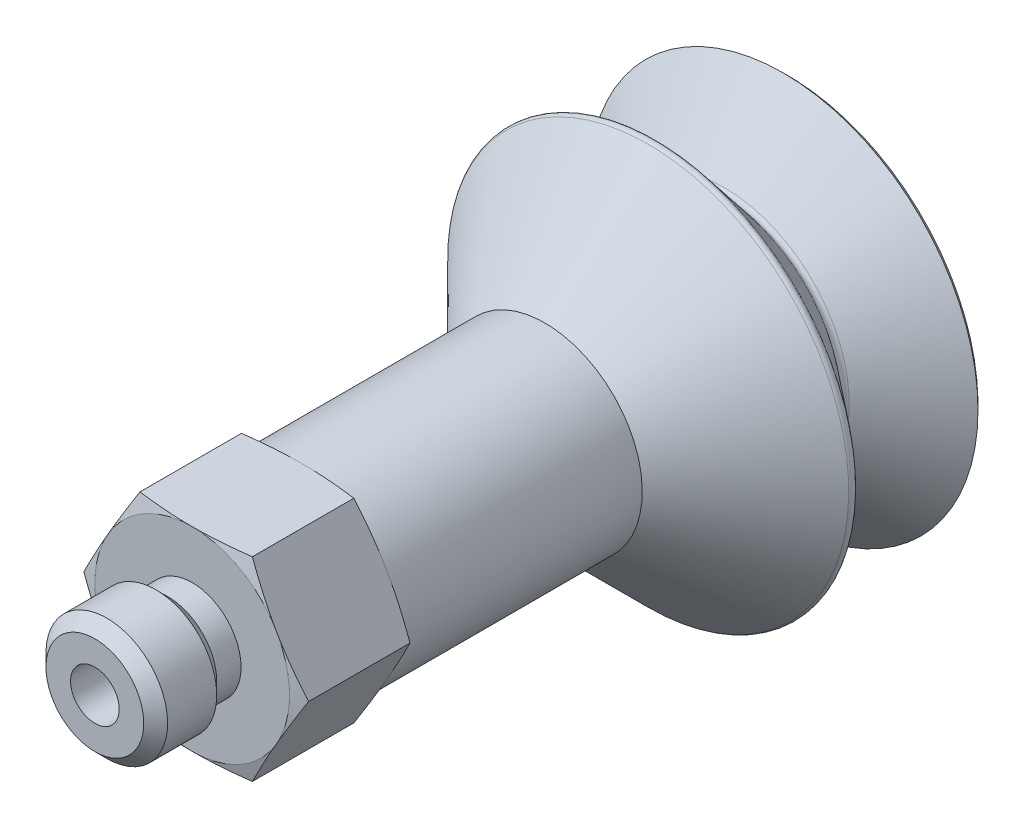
ISO-10303-21;
HEADER;
FILE_DESCRIPTION(('STEP AP214'),'2;1');
FILE_NAME('part.step','',(''),(''),'','','');
FILE_SCHEMA(('AUTOMOTIVE_DESIGN { 1 0 10303 214 1 1 1 1 }'));
ENDSEC;
DATA;
#1=APPLICATION_CONTEXT('core data for automotive mechanical design processes');
#2=APPLICATION_PROTOCOL_DEFINITION('international standard','automotive_design',2000,#1);
#3=PRODUCT_CONTEXT('',#1,'mechanical');
#4=PRODUCT('Part','Part','',(#3));
#5=PRODUCT_RELATED_PRODUCT_CATEGORY('part','',(#4));
#6=PRODUCT_DEFINITION_FORMATION('','',#4);
#7=PRODUCT_DEFINITION_CONTEXT('part definition',#1,'design');
#8=PRODUCT_DEFINITION('design','',#6,#7);
#9=PRODUCT_DEFINITION_SHAPE('','',#8);
#10=(LENGTH_UNIT() NAMED_UNIT(*) SI_UNIT(.MILLI.,.METRE.));
#11=(NAMED_UNIT(*) PLANE_ANGLE_UNIT() SI_UNIT($,.RADIAN.));
#12=(NAMED_UNIT(*) SI_UNIT($,.STERADIAN.) SOLID_ANGLE_UNIT());
#13=UNCERTAINTY_MEASURE_WITH_UNIT(LENGTH_MEASURE(1.E-05),#10,'distance_accuracy_value','');
#14=(GEOMETRIC_REPRESENTATION_CONTEXT(3) GLOBAL_UNCERTAINTY_ASSIGNED_CONTEXT((#13)) GLOBAL_UNIT_ASSIGNED_CONTEXT((#10,
#11,#12)) REPRESENTATION_CONTEXT('',''));
#15=CARTESIAN_POINT('',(0.,0.,0.));
#16=DIRECTION('',(0.,0.,1.));
#17=DIRECTION('',(1.,0.,0.));
#18=AXIS2_PLACEMENT_3D('',#15,#16,#17);
#19=CARTESIAN_POINT('',(4.61880215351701,0.,24.5));
#20=DIRECTION('',(-0.866025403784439,-0.5,0.));
#21=DIRECTION('',(0.,0.,-1.));
#22=AXIS2_PLACEMENT_3D('',#19,#20,#21);
#23=PLANE('',#22);
#24=CARTESIAN_POINT('',(4.61880215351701,0.,20.1658075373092));
#25=CARTESIAN_POINT('',(4.0000000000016,1.07179676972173,20.));
#26=CARTESIAN_POINT('',(3.46410161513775,2.00000000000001,20.));
#27=B_SPLINE_CURVE_WITH_KNOTS('',2,(#24,#25,#26),.UNSPECIFIED.,.F.,.F.,(3,3),(0.,1.),.UNSPECIFIED.);
#28=CARTESIAN_POINT('',(4.61880215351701,0.,20.1658075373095));
#29=VERTEX_POINT('',#28);
#30=CARTESIAN_POINT('',(3.46410161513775,2.,20.));
#31=VERTEX_POINT('',#30);
#32=EDGE_CURVE('E597',#29,#31,#27,.T.);
#33=ORIENTED_EDGE('',*,*,#32,.T.);
#34=CARTESIAN_POINT('',(3.46410161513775,2.00000000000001,20.));
#35=CARTESIAN_POINT('',(2.92820323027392,2.92820323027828,20.));
#36=CARTESIAN_POINT('',(2.30940107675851,4.,20.1658075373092));
#37=B_SPLINE_CURVE_WITH_KNOTS('',2,(#34,#35,#36),.UNSPECIFIED.,.F.,.F.,(3,3),(0.,1.),.UNSPECIFIED.);
#38=CARTESIAN_POINT('',(2.3094010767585,4.,20.1658075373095));
#39=VERTEX_POINT('',#38);
#40=EDGE_CURVE('E615',#31,#39,#37,.T.);
#41=ORIENTED_EDGE('',*,*,#40,.T.);
#42=DIRECTION('',(0.,0.,-1.));
#43=VECTOR('',#42,1.);
#44=CARTESIAN_POINT('',(2.3094010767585,4.,24.5));
#45=LINE('',#44,#43);
#46=CARTESIAN_POINT('',(2.3094010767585,4.,24.3341924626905));
#47=VERTEX_POINT('',#46);
#48=EDGE_CURVE('E10',#47,#39,#45,.T.);
#49=ORIENTED_EDGE('',*,*,#48,.F.);
#50=CARTESIAN_POINT('',(2.30940107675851,4.,24.3341924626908));
#51=CARTESIAN_POINT('',(2.92820323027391,2.92820323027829,24.5));
#52=CARTESIAN_POINT('',(3.46410161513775,2.00000000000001,24.5));
#53=B_SPLINE_CURVE_WITH_KNOTS('',2,(#50,#51,#52),.UNSPECIFIED.,.F.,.F.,(3,3),(0.,1.),.UNSPECIFIED.);
#54=CARTESIAN_POINT('',(3.46410161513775,2.,24.5));
#55=VERTEX_POINT('',#54);
#56=EDGE_CURVE('E663',#47,#55,#53,.T.);
#57=ORIENTED_EDGE('',*,*,#56,.T.);
#58=CARTESIAN_POINT('',(3.46410161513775,2.00000000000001,24.5));
#59=CARTESIAN_POINT('',(4.00000000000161,1.07179676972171,24.5));
#60=CARTESIAN_POINT('',(4.61880215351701,0.,24.3341924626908));
#61=B_SPLINE_CURVE_WITH_KNOTS('',2,(#58,#59,#60),.UNSPECIFIED.,.F.,.F.,(3,3),(0.,1.),.UNSPECIFIED.);
#62=CARTESIAN_POINT('',(4.61880215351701,0.,24.3341924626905));
#63=VERTEX_POINT('',#62);
#64=EDGE_CURVE('E658',#55,#63,#61,.T.);
#65=ORIENTED_EDGE('',*,*,#64,.T.);
#66=DIRECTION('',(0.,0.,-1.));
#67=VECTOR('',#66,1.);
#68=CARTESIAN_POINT('',(4.61880215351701,0.,24.5));
#69=LINE('',#68,#67);
#70=EDGE_CURVE('E740',#63,#29,#69,.T.);
#71=ORIENTED_EDGE('',*,*,#70,.T.);
#72=EDGE_LOOP('',(#33,#41,#49,#57,#65,#71));
#73=FACE_BOUND('',#72,.T.);
#74=ADVANCED_FACE('F15',(#73),#23,.F.);
#75=CARTESIAN_POINT('',(2.3094010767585,4.,24.5));
#76=DIRECTION('',(0.,-1.,0.));
#77=DIRECTION('',(0.,0.,-1.));
#78=AXIS2_PLACEMENT_3D('',#75,#76,#77);
#79=PLANE('',#78);
#80=CARTESIAN_POINT('',(2.3094010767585,4.,20.1658075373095));
#81=CARTESIAN_POINT('',(1.07179676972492,4.,20.));
#82=CARTESIAN_POINT('',(0.,4.,20.));
#83=B_SPLINE_CURVE_WITH_KNOTS('',2,(#80,#81,#82),.UNSPECIFIED.,.F.,.F.,(3,3),(0.,1.),.UNSPECIFIED.);
#84=CARTESIAN_POINT('',(0.,4.,20.));
#85=VERTEX_POINT('',#84);
#86=EDGE_CURVE('E581',#39,#85,#83,.T.);
#87=ORIENTED_EDGE('',*,*,#86,.T.);
#88=CARTESIAN_POINT('',(0.,4.,20.));
#89=CARTESIAN_POINT('',(-1.07179676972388,4.,20.));
#90=CARTESIAN_POINT('',(-2.3094010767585,4.,20.1658075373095));
#91=B_SPLINE_CURVE_WITH_KNOTS('',2,(#88,#89,#90),.UNSPECIFIED.,.F.,.F.,(3,3),(0.,1.),.UNSPECIFIED.);
#92=CARTESIAN_POINT('',(-2.3094010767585,4.,20.1658075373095));
#93=VERTEX_POINT('',#92);
#94=EDGE_CURVE('E567',#85,#93,#91,.T.);
#95=ORIENTED_EDGE('',*,*,#94,.T.);
#96=DIRECTION('',(0.,0.,-1.));
#97=VECTOR('',#96,1.);
#98=CARTESIAN_POINT('',(-2.3094010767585,4.,24.5));
#99=LINE('',#98,#97);
#100=CARTESIAN_POINT('',(-2.3094010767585,4.,24.3341924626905));
#101=VERTEX_POINT('',#100);
#102=EDGE_CURVE('E29',#101,#93,#99,.T.);
#103=ORIENTED_EDGE('',*,*,#102,.F.);
#104=CARTESIAN_POINT('',(-2.3094010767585,4.,24.3341924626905));
#105=CARTESIAN_POINT('',(-1.07179676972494,4.,24.5));
#106=CARTESIAN_POINT('',(0.,4.,24.5));
#107=B_SPLINE_CURVE_WITH_KNOTS('',2,(#104,#105,#106),.UNSPECIFIED.,.F.,.F.,(3,3),(0.,1.),.UNSPECIFIED.);
#108=CARTESIAN_POINT('',(0.,4.,24.5));
#109=VERTEX_POINT('',#108);
#110=EDGE_CURVE('E519',#101,#109,#107,.T.);
#111=ORIENTED_EDGE('',*,*,#110,.T.);
#112=CARTESIAN_POINT('',(0.,4.,24.5));
#113=CARTESIAN_POINT('',(1.07179676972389,4.,24.5));
#114=CARTESIAN_POINT('',(2.30940107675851,4.,24.3341924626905));
#115=B_SPLINE_CURVE_WITH_KNOTS('',2,(#112,#113,#114),.UNSPECIFIED.,.F.,.F.,(3,3),(0.,1.),.UNSPECIFIED.);
#116=EDGE_CURVE('E641',#109,#47,#115,.T.);
#117=ORIENTED_EDGE('',*,*,#116,.T.);
#118=ORIENTED_EDGE('',*,*,#48,.T.);
#119=EDGE_LOOP('',(#87,#95,#103,#111,#117,#118));
#120=FACE_BOUND('',#119,.T.);
#121=ADVANCED_FACE('F232',(#120),#79,.F.);
#122=CARTESIAN_POINT('',(-2.3094010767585,4.,24.5));
#123=DIRECTION('',(0.866025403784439,-0.5,0.));
#124=DIRECTION('',(0.5,0.866025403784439,0.));
#125=AXIS2_PLACEMENT_3D('',#122,#123,#124);
#126=PLANE('',#125);
#127=CARTESIAN_POINT('',(-2.3094010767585,4.,20.1658075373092));
#128=CARTESIAN_POINT('',(-2.92820323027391,2.92820323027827,20.));
#129=CARTESIAN_POINT('',(-3.46410161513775,1.99999999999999,20.));
#130=B_SPLINE_CURVE_WITH_KNOTS('',2,(#127,#128,#129),.UNSPECIFIED.,.F.,.F.,(3,3),(0.,1.),.UNSPECIFIED.);
#131=CARTESIAN_POINT('',(-3.46410161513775,2.,20.));
#132=VERTEX_POINT('',#131);
#133=EDGE_CURVE('E420',#93,#132,#130,.T.);
#134=ORIENTED_EDGE('',*,*,#133,.T.);
#135=CARTESIAN_POINT('',(-3.46410161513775,2.,20.));
#136=CARTESIAN_POINT('',(-4.0000000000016,1.07179676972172,20.));
#137=CARTESIAN_POINT('',(-4.618802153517,0.,20.1658075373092));
#138=B_SPLINE_CURVE_WITH_KNOTS('',2,(#135,#136,#137),.UNSPECIFIED.,.F.,.F.,(3,3),(0.,1.),.UNSPECIFIED.);
#139=CARTESIAN_POINT('',(-4.61880215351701,0.,20.1658075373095));
#140=VERTEX_POINT('',#139);
#141=EDGE_CURVE('E205',#132,#140,#138,.T.);
#142=ORIENTED_EDGE('',*,*,#141,.T.);
#143=DIRECTION('',(0.,0.,-1.));
#144=VECTOR('',#143,1.);
#145=CARTESIAN_POINT('',(-4.61880215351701,0.,24.5));
#146=LINE('',#145,#144);
#147=CARTESIAN_POINT('',(-4.61880215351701,0.,24.3341924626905));
#148=VERTEX_POINT('',#147);
#149=EDGE_CURVE('E194',#148,#140,#146,.T.);
#150=ORIENTED_EDGE('',*,*,#149,.F.);
#151=CARTESIAN_POINT('',(-4.618802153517,0.,24.3341924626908));
#152=CARTESIAN_POINT('',(-4.0000000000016,1.07179676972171,24.5));
#153=CARTESIAN_POINT('',(-3.46410161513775,2.,24.5));
#154=B_SPLINE_CURVE_WITH_KNOTS('',2,(#151,#152,#153),.UNSPECIFIED.,.F.,.F.,(3,3),(0.,1.),.UNSPECIFIED.);
#155=CARTESIAN_POINT('',(-3.46410161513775,2.,24.5));
#156=VERTEX_POINT('',#155);
#157=EDGE_CURVE('E459',#148,#156,#154,.T.);
#158=ORIENTED_EDGE('',*,*,#157,.T.);
#159=CARTESIAN_POINT('',(-3.46410161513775,2.,24.5));
#160=CARTESIAN_POINT('',(-2.9282032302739,2.9282032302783,24.5));
#161=CARTESIAN_POINT('',(-2.3094010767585,4.,24.3341924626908));
#162=B_SPLINE_CURVE_WITH_KNOTS('',2,(#159,#160,#161),.UNSPECIFIED.,.F.,.F.,(3,3),(0.,1.),.UNSPECIFIED.);
#163=EDGE_CURVE('E509',#156,#101,#162,.T.);
#164=ORIENTED_EDGE('',*,*,#163,.T.);
#165=ORIENTED_EDGE('',*,*,#102,.T.);
#166=EDGE_LOOP('',(#134,#142,#150,#158,#164,#165));
#167=FACE_BOUND('',#166,.T.);
#168=ADVANCED_FACE('F231',(#167),#126,.F.);
#169=CARTESIAN_POINT('',(-4.61880215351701,0.,24.5));
#170=DIRECTION('',(0.866025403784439,0.5,0.));
#171=DIRECTION('',(0.,0.,1.));
#172=AXIS2_PLACEMENT_3D('',#169,#170,#171);
#173=PLANE('',#172);
#174=CARTESIAN_POINT('',(-4.61880215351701,0.,20.1658075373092));
#175=CARTESIAN_POINT('',(-4.0000000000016,-1.07179676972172,20.));
#176=CARTESIAN_POINT('',(-3.46410161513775,-2.00000000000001,20.));
#177=B_SPLINE_CURVE_WITH_KNOTS('',2,(#174,#175,#176),.UNSPECIFIED.,.F.,.F.,(3,3),(0.,1.),.UNSPECIFIED.);
#178=CARTESIAN_POINT('',(-3.46410161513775,-2.,20.));
#179=VERTEX_POINT('',#178);
#180=EDGE_CURVE('E212',#140,#179,#177,.T.);
#181=ORIENTED_EDGE('',*,*,#180,.T.);
#182=CARTESIAN_POINT('',(-3.46410161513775,-2.00000000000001,20.));
#183=CARTESIAN_POINT('',(-2.92820323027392,-2.92820323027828,20.));
#184=CARTESIAN_POINT('',(-2.30940107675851,-4.,20.1658075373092));
#185=B_SPLINE_CURVE_WITH_KNOTS('',2,(#182,#183,#184),.UNSPECIFIED.,.F.,.F.,(3,3),(0.,1.),.UNSPECIFIED.);
#186=CARTESIAN_POINT('',(-2.3094010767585,-4.,20.1658075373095));
#187=VERTEX_POINT('',#186);
#188=EDGE_CURVE('E201',#179,#187,#185,.T.);
#189=ORIENTED_EDGE('',*,*,#188,.T.);
#190=DIRECTION('',(0.,0.,-1.));
#191=VECTOR('',#190,1.);
#192=CARTESIAN_POINT('',(-2.3094010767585,-4.,24.5));
#193=LINE('',#192,#191);
#194=CARTESIAN_POINT('',(-2.3094010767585,-4.,24.3341924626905));
#195=VERTEX_POINT('',#194);
#196=EDGE_CURVE('E178',#195,#187,#193,.T.);
#197=ORIENTED_EDGE('',*,*,#196,.F.);
#198=CARTESIAN_POINT('',(-2.30940107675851,-4.,24.3341924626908));
#199=CARTESIAN_POINT('',(-2.92820323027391,-2.92820323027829,24.5));
#200=CARTESIAN_POINT('',(-3.46410161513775,-2.00000000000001,24.5));
#201=B_SPLINE_CURVE_WITH_KNOTS('',2,(#198,#199,#200),.UNSPECIFIED.,.F.,.F.,(3,3),(0.,1.),.UNSPECIFIED.);
#202=CARTESIAN_POINT('',(-3.46410161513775,-2.,24.5));
#203=VERTEX_POINT('',#202);
#204=EDGE_CURVE('E485',#195,#203,#201,.T.);
#205=ORIENTED_EDGE('',*,*,#204,.T.);
#206=CARTESIAN_POINT('',(-3.46410161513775,-2.00000000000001,24.5));
#207=CARTESIAN_POINT('',(-4.00000000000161,-1.07179676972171,24.5));
#208=CARTESIAN_POINT('',(-4.61880215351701,0.,24.3341924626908));
#209=B_SPLINE_CURVE_WITH_KNOTS('',2,(#206,#207,#208),.UNSPECIFIED.,.F.,.F.,(3,3),(0.,1.),.UNSPECIFIED.);
#210=EDGE_CURVE('E522',#203,#148,#209,.T.);
#211=ORIENTED_EDGE('',*,*,#210,.T.);
#212=ORIENTED_EDGE('',*,*,#149,.T.);
#213=EDGE_LOOP('',(#181,#189,#197,#205,#211,#212));
#214=FACE_BOUND('',#213,.T.);
#215=ADVANCED_FACE('F209',(#214),#173,.F.);
#216=CARTESIAN_POINT('',(-2.3094010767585,-4.,24.5));
#217=DIRECTION('',(0.,1.,0.));
#218=DIRECTION('',(-1.,0.,0.));
#219=AXIS2_PLACEMENT_3D('',#216,#217,#218);
#220=PLANE('',#219);
#221=CARTESIAN_POINT('',(-2.3094010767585,-4.,20.1658075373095));
#222=CARTESIAN_POINT('',(-1.07179676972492,-4.,20.));
#223=CARTESIAN_POINT('',(0.,-4.,20.));
#224=B_SPLINE_CURVE_WITH_KNOTS('',2,(#221,#222,#223),.UNSPECIFIED.,.F.,.F.,(3,3),(0.,1.),.UNSPECIFIED.);
#225=CARTESIAN_POINT('',(0.,-4.,20.));
#226=VERTEX_POINT('',#225);
#227=EDGE_CURVE('E182',#187,#226,#224,.T.);
#228=ORIENTED_EDGE('',*,*,#227,.T.);
#229=CARTESIAN_POINT('',(0.,-4.,20.));
#230=CARTESIAN_POINT('',(1.07179676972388,-4.,20.));
#231=CARTESIAN_POINT('',(2.3094010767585,-4.,20.1658075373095));
#232=B_SPLINE_CURVE_WITH_KNOTS('',2,(#229,#230,#231),.UNSPECIFIED.,.F.,.F.,(3,3),(0.,1.),.UNSPECIFIED.);
#233=CARTESIAN_POINT('',(2.3094010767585,-4.,20.1658075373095));
#234=VERTEX_POINT('',#233);
#235=EDGE_CURVE('E339',#226,#234,#232,.T.);
#236=ORIENTED_EDGE('',*,*,#235,.T.);
#237=DIRECTION('',(0.,0.,-1.));
#238=VECTOR('',#237,1.);
#239=CARTESIAN_POINT('',(2.3094010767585,-4.,24.5));
#240=LINE('',#239,#238);
#241=CARTESIAN_POINT('',(2.3094010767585,-4.,24.3341924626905));
#242=VERTEX_POINT('',#241);
#243=EDGE_CURVE('E195',#242,#234,#240,.T.);
#244=ORIENTED_EDGE('',*,*,#243,.F.);
#245=CARTESIAN_POINT('',(2.3094010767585,-4.,24.3341924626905));
#246=CARTESIAN_POINT('',(1.07179676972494,-4.,24.5));
#247=CARTESIAN_POINT('',(0.,-4.,24.5));
#248=B_SPLINE_CURVE_WITH_KNOTS('',2,(#245,#246,#247),.UNSPECIFIED.,.F.,.F.,(3,3),(0.,1.),.UNSPECIFIED.);
#249=CARTESIAN_POINT('',(0.,-4.,24.5));
#250=VERTEX_POINT('',#249);
#251=EDGE_CURVE('E1290',#242,#250,#248,.T.);
#252=ORIENTED_EDGE('',*,*,#251,.T.);
#253=CARTESIAN_POINT('',(0.,-4.,24.5));
#254=CARTESIAN_POINT('',(-1.07179676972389,-4.,24.5));
#255=CARTESIAN_POINT('',(-2.30940107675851,-4.,24.3341924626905));
#256=B_SPLINE_CURVE_WITH_KNOTS('',2,(#253,#254,#255),.UNSPECIFIED.,.F.,.F.,(3,3),(0.,1.),.UNSPECIFIED.);
#257=EDGE_CURVE('E187',#250,#195,#256,.T.);
#258=ORIENTED_EDGE('',*,*,#257,.T.);
#259=ORIENTED_EDGE('',*,*,#196,.T.);
#260=EDGE_LOOP('',(#228,#236,#244,#252,#258,#259));
#261=FACE_BOUND('',#260,.T.);
#262=ADVANCED_FACE('F180',(#261),#220,.F.);
#263=CARTESIAN_POINT('',(2.3094010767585,-4.,24.5));
#264=DIRECTION('',(-0.866025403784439,0.5,0.));
#265=DIRECTION('',(0.,0.,-1.));
#266=AXIS2_PLACEMENT_3D('',#263,#264,#265);
#267=PLANE('',#266);
#268=CARTESIAN_POINT('',(2.3094010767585,-4.,20.1658075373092));
#269=CARTESIAN_POINT('',(2.92820323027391,-2.92820323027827,20.));
#270=CARTESIAN_POINT('',(3.46410161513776,-2.,20.));
#271=B_SPLINE_CURVE_WITH_KNOTS('',2,(#268,#269,#270),.UNSPECIFIED.,.F.,.F.,(3,3),(0.,1.),.UNSPECIFIED.);
#272=CARTESIAN_POINT('',(3.46410161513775,-2.,20.));
#273=VERTEX_POINT('',#272);
#274=EDGE_CURVE('E369',#234,#273,#271,.T.);
#275=ORIENTED_EDGE('',*,*,#274,.T.);
#276=CARTESIAN_POINT('',(3.46410161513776,-2.,20.));
#277=CARTESIAN_POINT('',(4.0000000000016,-1.07179676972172,20.));
#278=CARTESIAN_POINT('',(4.61880215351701,0.,20.1658075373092));
#279=B_SPLINE_CURVE_WITH_KNOTS('',2,(#276,#277,#278),.UNSPECIFIED.,.F.,.F.,(3,3),(0.,1.),.UNSPECIFIED.);
#280=EDGE_CURVE('E566',#273,#29,#279,.T.);
#281=ORIENTED_EDGE('',*,*,#280,.T.);
#282=ORIENTED_EDGE('',*,*,#70,.F.);
#283=CARTESIAN_POINT('',(4.61880215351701,0.,24.3341924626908));
#284=CARTESIAN_POINT('',(4.00000000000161,-1.07179676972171,24.5));
#285=CARTESIAN_POINT('',(3.46410161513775,-2.,24.5));
#286=B_SPLINE_CURVE_WITH_KNOTS('',2,(#283,#284,#285),.UNSPECIFIED.,.F.,.F.,(3,3),(0.,1.),.UNSPECIFIED.);
#287=CARTESIAN_POINT('',(3.46410161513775,-2.,24.5));
#288=VERTEX_POINT('',#287);
#289=EDGE_CURVE('E801',#63,#288,#286,.T.);
#290=ORIENTED_EDGE('',*,*,#289,.T.);
#291=CARTESIAN_POINT('',(3.46410161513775,-2.,24.5));
#292=CARTESIAN_POINT('',(2.9282032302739,-2.92820323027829,24.5));
#293=CARTESIAN_POINT('',(2.3094010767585,-4.,24.3341924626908));
#294=B_SPLINE_CURVE_WITH_KNOTS('',2,(#291,#292,#293),.UNSPECIFIED.,.F.,.F.,(3,3),(0.,1.),.UNSPECIFIED.);
#295=EDGE_CURVE('E657',#288,#242,#294,.T.);
#296=ORIENTED_EDGE('',*,*,#295,.T.);
#297=ORIENTED_EDGE('',*,*,#243,.T.);
#298=EDGE_LOOP('',(#275,#281,#282,#290,#296,#297));
#299=FACE_BOUND('',#298,.T.);
#300=ADVANCED_FACE('F280',(#299),#267,.F.);
#301=CARTESIAN_POINT('',(-2.0095,0.,28.5));
#302=DIRECTION('',(0.,0.,1.));
#303=DIRECTION('',(-1.,0.,0.));
#304=AXIS2_PLACEMENT_3D('',#301,#302,#303);
#305=PLANE('',#304);
#306=CARTESIAN_POINT('',(0.,0.,28.5));
#307=DIRECTION('',(0.,0.,-1.));
#308=DIRECTION('',(0.,-1.,0.));
#309=AXIS2_PLACEMENT_3D('',#306,#307,#308);
#310=CIRCLE('',#309,2.0095);
#311=CARTESIAN_POINT('',(0.,-2.0095,28.5));
#312=VERTEX_POINT('',#311);
#313=EDGE_CURVE('E41',#312,#312,#310,.T.);
#314=ORIENTED_EDGE('',*,*,#313,.F.);
#315=EDGE_LOOP('',(#314));
#316=FACE_BOUND('',#315,.T.);
#317=CARTESIAN_POINT('',(0.,0.,28.5));
#318=DIRECTION('',(0.,0.,-1.));
#319=DIRECTION('',(0.,-1.,0.));
#320=AXIS2_PLACEMENT_3D('',#317,#318,#319);
#321=CIRCLE('',#320,1.);
#322=CARTESIAN_POINT('',(0.,-1.,28.5));
#323=VERTEX_POINT('',#322);
#324=EDGE_CURVE('E704',#323,#323,#321,.T.);
#325=ORIENTED_EDGE('',*,*,#324,.T.);
#326=EDGE_LOOP('',(#325));
#327=FACE_BOUND('',#326,.T.);
#328=ADVANCED_FACE('F823',(#316,#327),#305,.T.);
#329=CARTESIAN_POINT('',(0.,0.,28.0095));
#330=DIRECTION('',(0.,0.,-1.));
#331=DIRECTION('',(0.,-1.,0.));
#332=AXIS2_PLACEMENT_3D('',#329,#330,#331);
#333=CONICAL_SURFACE('',#332,2.5,0.785398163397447);
#334=CARTESIAN_POINT('',(0.,0.,28.0095));
#335=DIRECTION('',(0.,0.,-1.));
#336=DIRECTION('',(0.,-1.,0.));
#337=AXIS2_PLACEMENT_3D('',#334,#335,#336);
#338=CIRCLE('',#337,2.5);
#339=CARTESIAN_POINT('',(0.,-2.5,28.0095));
#340=VERTEX_POINT('',#339);
#341=EDGE_CURVE('E694',#340,#340,#338,.T.);
#342=ORIENTED_EDGE('',*,*,#341,.F.);
#343=EDGE_LOOP('',(#342));
#344=FACE_BOUND('',#343,.T.);
#345=ORIENTED_EDGE('',*,*,#313,.T.);
#346=EDGE_LOOP('',(#345));
#347=FACE_BOUND('',#346,.T.);
#348=ADVANCED_FACE('F1163',(#344,#347),#333,.T.);
#349=CARTESIAN_POINT('',(0.,0.,20.));
#350=DIRECTION('',(0.,0.,-1.));
#351=DIRECTION('',(0.,-1.,0.));
#352=AXIS2_PLACEMENT_3D('',#349,#350,#351);
#353=CYLINDRICAL_SURFACE('',#352,2.5);
#354=CARTESIAN_POINT('',(0.,0.,25.9905));
#355=DIRECTION('',(0.,0.,-1.));
#356=DIRECTION('',(0.,-1.,0.));
#357=AXIS2_PLACEMENT_3D('',#354,#355,#356);
#358=CIRCLE('',#357,2.5);
#359=CARTESIAN_POINT('',(0.,-2.5,25.9905));
#360=VERTEX_POINT('',#359);
#361=EDGE_CURVE('E697',#360,#360,#358,.T.);
#362=ORIENTED_EDGE('',*,*,#361,.F.);
#363=EDGE_LOOP('',(#362));
#364=FACE_BOUND('',#363,.T.);
#365=ORIENTED_EDGE('',*,*,#341,.T.);
#366=EDGE_LOOP('',(#365));
#367=FACE_BOUND('',#366,.T.);
#368=ADVANCED_FACE('F1152',(#364,#367),#353,.T.);
#369=CARTESIAN_POINT('',(0.,0.,25.5));
#370=DIRECTION('',(0.,0.,1.));
#371=DIRECTION('',(0.,1.,0.));
#372=AXIS2_PLACEMENT_3D('',#369,#370,#371);
#373=CONICAL_SURFACE('',#372,2.0095,0.78539816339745);
#374=CARTESIAN_POINT('',(0.,0.,25.5));
#375=DIRECTION('',(0.,0.,-1.));
#376=DIRECTION('',(0.,-1.,0.));
#377=AXIS2_PLACEMENT_3D('',#374,#375,#376);
#378=CIRCLE('',#377,2.0095);
#379=CARTESIAN_POINT('',(0.,-2.0095,25.5));
#380=VERTEX_POINT('',#379);
#381=EDGE_CURVE('E710',#380,#380,#378,.T.);
#382=ORIENTED_EDGE('',*,*,#381,.F.);
#383=EDGE_LOOP('',(#382));
#384=FACE_BOUND('',#383,.T.);
#385=ORIENTED_EDGE('',*,*,#361,.T.);
#386=EDGE_LOOP('',(#385));
#387=FACE_BOUND('',#386,.T.);
#388=ADVANCED_FACE('F863',(#384,#387),#373,.T.);
#389=CARTESIAN_POINT('',(0.,0.,20.));
#390=DIRECTION('',(0.,0.,-1.));
#391=DIRECTION('',(0.,-1.,0.));
#392=AXIS2_PLACEMENT_3D('',#389,#390,#391);
#393=CYLINDRICAL_SURFACE('',#392,2.0095);
#394=CARTESIAN_POINT('',(0.,0.,24.5));
#395=DIRECTION('',(0.,0.,-1.));
#396=DIRECTION('',(0.,-1.,0.));
#397=AXIS2_PLACEMENT_3D('',#394,#395,#396);
#398=CIRCLE('',#397,2.0095);
#399=CARTESIAN_POINT('',(0.,-2.0095,24.5));
#400=VERTEX_POINT('',#399);
#401=EDGE_CURVE('E707',#400,#400,#398,.T.);
#402=ORIENTED_EDGE('',*,*,#401,.F.);
#403=EDGE_LOOP('',(#402));
#404=FACE_BOUND('',#403,.T.);
#405=ORIENTED_EDGE('',*,*,#381,.T.);
#406=EDGE_LOOP('',(#405));
#407=FACE_BOUND('',#406,.T.);
#408=ADVANCED_FACE('F861',(#404,#407),#393,.T.);
#409=CARTESIAN_POINT('',(-4.,0.,24.5));
#410=DIRECTION('',(0.,0.,1.));
#411=DIRECTION('',(-1.,0.,0.));
#412=AXIS2_PLACEMENT_3D('',#409,#410,#411);
#413=PLANE('',#412);
#414=CARTESIAN_POINT('',(0.,0.,24.5));
#415=DIRECTION('',(0.,0.,-1.));
#416=DIRECTION('',(0.,-1.,0.));
#417=AXIS2_PLACEMENT_3D('',#414,#415,#416);
#418=CIRCLE('',#417,4.);
#419=EDGE_CURVE('E515',#203,#156,#418,.T.);
#420=ORIENTED_EDGE('',*,*,#419,.F.);
#421=CARTESIAN_POINT('',(0.,0.,24.5));
#422=DIRECTION('',(0.,0.,-1.));
#423=DIRECTION('',(0.,-1.,0.));
#424=AXIS2_PLACEMENT_3D('',#421,#422,#423);
#425=CIRCLE('',#424,4.);
#426=EDGE_CURVE('E476',#250,#203,#425,.T.);
#427=ORIENTED_EDGE('',*,*,#426,.F.);
#428=CARTESIAN_POINT('',(0.,0.,24.5));
#429=DIRECTION('',(0.,0.,-1.));
#430=DIRECTION('',(0.,-1.,0.));
#431=AXIS2_PLACEMENT_3D('',#428,#429,#430);
#432=CIRCLE('',#431,4.);
#433=EDGE_CURVE('E1297',#288,#250,#432,.T.);
#434=ORIENTED_EDGE('',*,*,#433,.F.);
#435=CARTESIAN_POINT('',(0.,0.,24.5));
#436=DIRECTION('',(0.,0.,-1.));
#437=DIRECTION('',(0.,-1.,0.));
#438=AXIS2_PLACEMENT_3D('',#435,#436,#437);
#439=CIRCLE('',#438,4.);
#440=EDGE_CURVE('E653',#55,#288,#439,.T.);
#441=ORIENTED_EDGE('',*,*,#440,.F.);
#442=CARTESIAN_POINT('',(0.,0.,24.5));
#443=DIRECTION('',(0.,0.,-1.));
#444=DIRECTION('',(0.,-1.,0.));
#445=AXIS2_PLACEMENT_3D('',#442,#443,#444);
#446=CIRCLE('',#445,4.);
#447=EDGE_CURVE('E543',#109,#55,#446,.T.);
#448=ORIENTED_EDGE('',*,*,#447,.F.);
#449=CARTESIAN_POINT('',(0.,0.,24.5));
#450=DIRECTION('',(0.,0.,-1.));
#451=DIRECTION('',(0.,-1.,0.));
#452=AXIS2_PLACEMENT_3D('',#449,#450,#451);
#453=CIRCLE('',#452,4.);
#454=EDGE_CURVE('E514',#156,#109,#453,.T.);
#455=ORIENTED_EDGE('',*,*,#454,.F.);
#456=EDGE_LOOP('',(#420,#427,#434,#441,#448,#455));
#457=FACE_BOUND('',#456,.T.);
#458=ORIENTED_EDGE('',*,*,#401,.T.);
#459=EDGE_LOOP('',(#458));
#460=FACE_BOUND('',#459,.T.);
#461=ADVANCED_FACE('F539',(#457,#460),#413,.T.);
#462=CARTESIAN_POINT('',(0.,0.,24.2856406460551));
#463=DIRECTION('',(0.,0.,-1.));
#464=DIRECTION('',(0.,-1.,0.));
#465=AXIS2_PLACEMENT_3D('',#462,#463,#464);
#466=CONICAL_SURFACE('',#465,4.8,1.30899693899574);
#467=ORIENTED_EDGE('',*,*,#116,.F.);
#468=ORIENTED_EDGE('',*,*,#447,.T.);
#469=ORIENTED_EDGE('',*,*,#56,.F.);
#470=EDGE_LOOP('',(#467,#468,#469));
#471=FACE_BOUND('',#470,.T.);
#472=ADVANCED_FACE('F431',(#471),#466,.T.);
#473=CARTESIAN_POINT('',(0.,0.,20.));
#474=DIRECTION('',(0.,0.,1.));
#475=DIRECTION('',(0.,1.,0.));
#476=AXIS2_PLACEMENT_3D('',#473,#474,#475);
#477=CONICAL_SURFACE('',#476,4.,1.30899693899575);
#478=ORIENTED_EDGE('',*,*,#86,.F.);
#479=ORIENTED_EDGE('',*,*,#40,.F.);
#480=CARTESIAN_POINT('',(0.,0.,20.));
#481=DIRECTION('',(0.,0.,-1.));
#482=DIRECTION('',(0.,-1.,0.));
#483=AXIS2_PLACEMENT_3D('',#480,#481,#482);
#484=CIRCLE('',#483,4.);
#485=EDGE_CURVE('E600',#85,#31,#484,.T.);
#486=ORIENTED_EDGE('',*,*,#485,.F.);
#487=EDGE_LOOP('',(#478,#479,#486));
#488=FACE_BOUND('',#487,.T.);
#489=ADVANCED_FACE('F282',(#488),#477,.T.);
#490=CARTESIAN_POINT('',(-1.,0.,20.));
#491=DIRECTION('',(0.,0.,-1.));
#492=DIRECTION('',(0.,-1.,0.));
#493=AXIS2_PLACEMENT_3D('',#490,#491,#492);
#494=PLANE('',#493);
#495=CARTESIAN_POINT('',(0.,0.,20.));
#496=DIRECTION('',(0.,0.,-1.));
#497=DIRECTION('',(0.,-1.,0.));
#498=AXIS2_PLACEMENT_3D('',#495,#496,#497);
#499=CIRCLE('',#498,1.);
#500=CARTESIAN_POINT('',(0.,-1.,20.));
#501=VERTEX_POINT('',#500);
#502=EDGE_CURVE('E604',#501,#501,#499,.T.);
#503=ORIENTED_EDGE('',*,*,#502,.F.);
#504=EDGE_LOOP('',(#503));
#505=FACE_BOUND('',#504,.T.);
#506=CARTESIAN_POINT('',(0.,0.,20.));
#507=DIRECTION('',(0.,0.,-1.));
#508=DIRECTION('',(0.,-1.,0.));
#509=AXIS2_PLACEMENT_3D('',#506,#507,#508);
#510=CIRCLE('',#509,2.);
#511=CARTESIAN_POINT('',(0.,-2.,20.));
#512=VERTEX_POINT('',#511);
#513=EDGE_CURVE('E698',#512,#512,#510,.T.);
#514=ORIENTED_EDGE('',*,*,#513,.T.);
#515=EDGE_LOOP('',(#514));
#516=FACE_BOUND('',#515,.T.);
#517=ADVANCED_FACE('F307',(#505,#516),#494,.T.);
#518=CARTESIAN_POINT('',(0.,0.,20.));
#519=DIRECTION('',(0.,0.,-1.));
#520=DIRECTION('',(0.,-1.,0.));
#521=AXIS2_PLACEMENT_3D('',#518,#519,#520);
#522=CYLINDRICAL_SURFACE('',#521,1.);
#523=ORIENTED_EDGE('',*,*,#324,.F.);
#524=EDGE_LOOP('',(#523));
#525=FACE_BOUND('',#524,.T.);
#526=ORIENTED_EDGE('',*,*,#502,.T.);
#527=EDGE_LOOP('',(#526));
#528=FACE_BOUND('',#527,.T.);
#529=ADVANCED_FACE('F825',(#525,#528),#522,.F.);
#530=CARTESIAN_POINT('',(0.,0.,0.));
#531=DIRECTION('',(0.,0.,-1.));
#532=DIRECTION('',(0.,-1.,0.));
#533=AXIS2_PLACEMENT_3D('',#530,#531,#532);
#534=CYLINDRICAL_SURFACE('',#533,4.);
#535=CARTESIAN_POINT('',(0.,0.,10.));
#536=DIRECTION('',(0.,0.,-1.));
#537=DIRECTION('',(0.,-1.,0.));
#538=AXIS2_PLACEMENT_3D('',#535,#536,#537);
#539=CIRCLE('',#538,4.);
#540=CARTESIAN_POINT('',(0.,-4.,10.));
#541=VERTEX_POINT('',#540);
#542=EDGE_CURVE('E156',#541,#541,#539,.T.);
#543=ORIENTED_EDGE('',*,*,#542,.F.);
#544=EDGE_LOOP('',(#543));
#545=FACE_BOUND('',#544,.T.);
#546=CARTESIAN_POINT('',(0.,0.,20.));
#547=DIRECTION('',(0.,0.,-1.));
#548=DIRECTION('',(0.,-1.,0.));
#549=AXIS2_PLACEMENT_3D('',#546,#547,#548);
#550=CIRCLE('',#549,4.);
#551=EDGE_CURVE('E203',#226,#179,#550,.T.);
#552=ORIENTED_EDGE('',*,*,#551,.T.);
#553=CARTESIAN_POINT('',(0.,0.,20.));
#554=DIRECTION('',(0.,0.,-1.));
#555=DIRECTION('',(0.,-1.,0.));
#556=AXIS2_PLACEMENT_3D('',#553,#554,#555);
#557=CIRCLE('',#556,4.);
#558=EDGE_CURVE('E383',#179,#132,#557,.T.);
#559=ORIENTED_EDGE('',*,*,#558,.T.);
#560=CARTESIAN_POINT('',(0.,0.,20.));
#561=DIRECTION('',(0.,0.,-1.));
#562=DIRECTION('',(0.,-1.,0.));
#563=AXIS2_PLACEMENT_3D('',#560,#561,#562);
#564=CIRCLE('',#563,4.);
#565=EDGE_CURVE('E562',#132,#85,#564,.T.);
#566=ORIENTED_EDGE('',*,*,#565,.T.);
#567=ORIENTED_EDGE('',*,*,#485,.T.);
#568=CARTESIAN_POINT('',(0.,0.,20.));
#569=DIRECTION('',(0.,0.,-1.));
#570=DIRECTION('',(0.,-1.,0.));
#571=AXIS2_PLACEMENT_3D('',#568,#569,#570);
#572=CIRCLE('',#571,4.);
#573=EDGE_CURVE('E593',#31,#273,#572,.T.);
#574=ORIENTED_EDGE('',*,*,#573,.T.);
#575=CARTESIAN_POINT('',(0.,0.,20.));
#576=DIRECTION('',(0.,0.,-1.));
#577=DIRECTION('',(0.,-1.,0.));
#578=AXIS2_PLACEMENT_3D('',#575,#576,#577);
#579=CIRCLE('',#578,4.);
#580=EDGE_CURVE('E807',#273,#226,#579,.T.);
#581=ORIENTED_EDGE('',*,*,#580,.T.);
#582=EDGE_LOOP('',(#552,#559,#566,#567,#574,#581));
#583=FACE_BOUND('',#582,.T.);
#584=ADVANCED_FACE('F806',(#545,#583),#534,.T.);
#585=CARTESIAN_POINT('',(0.,0.,5.75641778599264));
#586=DIRECTION('',(0.,0.,-1.));
#587=DIRECTION('',(0.,-1.,0.));
#588=AXIS2_PLACEMENT_3D('',#585,#586,#587);
#589=CONICAL_SURFACE('',#588,8.24358221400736,0.785398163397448);
#590=CARTESIAN_POINT('',(0.,0.,5.75641778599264));
#591=DIRECTION('',(0.,0.,-1.));
#592=DIRECTION('',(0.,-1.,0.));
#593=AXIS2_PLACEMENT_3D('',#590,#591,#592);
#594=CIRCLE('',#593,8.24358221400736);
#595=CARTESIAN_POINT('',(0.,-8.24358221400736,5.75641778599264));
#596=VERTEX_POINT('',#595);
#597=EDGE_CURVE('E146',#596,#596,#594,.T.);
#598=ORIENTED_EDGE('',*,*,#597,.F.);
#599=EDGE_LOOP('',(#598));
#600=FACE_BOUND('',#599,.T.);
#601=ORIENTED_EDGE('',*,*,#542,.T.);
#602=EDGE_LOOP('',(#601));
#603=FACE_BOUND('',#602,.T.);
#604=ADVANCED_FACE('F859',(#600,#603),#589,.T.);
#605=CARTESIAN_POINT('',(0.,0.,5.61499642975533));
#606=DIRECTION('',(0.,0.,-1.));
#607=DIRECTION('',(0.,-1.,0.));
#608=AXIS2_PLACEMENT_3D('',#605,#606,#607);
#609=TOROIDAL_SURFACE('',#608,8.10216085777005,0.2);
#610=CARTESIAN_POINT('',(0.,0.,5.46008498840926));
#611=DIRECTION('',(0.,0.,-1.));
#612=DIRECTION('',(0.,-1.,0.));
#613=AXIS2_PLACEMENT_3D('',#610,#611,#612);
#614=CIRCLE('',#613,8.22866162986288);
#615=CARTESIAN_POINT('',(0.,-8.22866162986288,5.46008498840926));
#616=VERTEX_POINT('',#615);
#617=EDGE_CURVE('E688',#616,#616,#614,.T.);
#618=ORIENTED_EDGE('',*,*,#617,.F.);
#619=EDGE_LOOP('',(#618));
#620=FACE_BOUND('',#619,.T.);
#621=ORIENTED_EDGE('',*,*,#597,.T.);
#622=EDGE_LOOP('',(#621));
#623=FACE_BOUND('',#622,.T.);
#624=ADVANCED_FACE('F783',(#620,#623),#609,.T.);
#625=CARTESIAN_POINT('',(0.,0.,2.92396828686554));
#626=DIRECTION('',(0.,0.,1.));
#627=DIRECTION('',(0.,1.,0.));
#628=AXIS2_PLACEMENT_3D('',#625,#626,#627);
#629=CONICAL_SURFACE('',#628,5.12296126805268,0.886014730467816);
#630=CARTESIAN_POINT('',(0.,0.,2.92396828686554));
#631=DIRECTION('',(0.,0.,-1.));
#632=DIRECTION('',(0.,-1.,0.));
#633=AXIS2_PLACEMENT_3D('',#630,#631,#632);
#634=CIRCLE('',#633,5.12296126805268);
#635=CARTESIAN_POINT('',(0.,-5.12296126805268,2.92396828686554));
#636=VERTEX_POINT('',#635);
#637=EDGE_CURVE('E692',#636,#636,#634,.T.);
#638=ORIENTED_EDGE('',*,*,#637,.F.);
#639=EDGE_LOOP('',(#638));
#640=FACE_BOUND('',#639,.T.);
#641=ORIENTED_EDGE('',*,*,#617,.T.);
#642=EDGE_LOOP('',(#641));
#643=FACE_BOUND('',#642,.T.);
#644=ADVANCED_FACE('F235',(#640,#643),#629,.T.);
#645=CARTESIAN_POINT('',(0.,0.,2.76905684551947));
#646=DIRECTION('',(0.,0.,-1.));
#647=DIRECTION('',(0.,-1.,0.));
#648=AXIS2_PLACEMENT_3D('',#645,#646,#647);
#649=TOROIDAL_SURFACE('',#648,5.24946204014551,0.2);
#650=ORIENTED_EDGE('',*,*,#637,.T.);
#651=EDGE_LOOP('',(#650));
#652=FACE_BOUND('',#651,.T.);
#653=CARTESIAN_POINT('',(0.,0.,2.61584795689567));
#654=DIRECTION('',(0.,0.,-1.));
#655=DIRECTION('',(0.,-1.,0.));
#656=AXIS2_PLACEMENT_3D('',#653,#654,#655);
#657=CIRCLE('',#656,5.1209045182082);
#658=CARTESIAN_POINT('',(0.,-5.1209045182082,2.61584795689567));
#659=VERTEX_POINT('',#658);
#660=EDGE_CURVE('E689',#659,#659,#657,.T.);
#661=ORIENTED_EDGE('',*,*,#660,.F.);
#662=EDGE_LOOP('',(#661));
#663=FACE_BOUND('',#662,.T.);
#664=ADVANCED_FACE('F772',(#652,#663),#649,.F.);
#665=CARTESIAN_POINT('',(0.,0.,0.2));
#666=DIRECTION('',(0.,0.,-1.));
#667=DIRECTION('',(0.,-1.,0.));
#668=AXIS2_PLACEMENT_3D('',#665,#666,#667);
#669=CONICAL_SURFACE('',#668,8.,0.872664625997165);
#670=CARTESIAN_POINT('',(0.,0.,0.2));
#671=DIRECTION('',(0.,0.,-1.));
#672=DIRECTION('',(0.,-1.,0.));
#673=AXIS2_PLACEMENT_3D('',#670,#671,#672);
#674=CIRCLE('',#673,8.);
#675=CARTESIAN_POINT('',(0.,-8.,0.2));
#676=VERTEX_POINT('',#675);
#677=EDGE_CURVE('E693',#676,#676,#674,.T.);
#678=ORIENTED_EDGE('',*,*,#677,.F.);
#679=EDGE_LOOP('',(#678));
#680=FACE_BOUND('',#679,.T.);
#681=ORIENTED_EDGE('',*,*,#660,.T.);
#682=EDGE_LOOP('',(#681));
#683=FACE_BOUND('',#682,.T.);
#684=ADVANCED_FACE('F767',(#680,#683),#669,.T.);
#685=CARTESIAN_POINT('',(0.,0.,0.));
#686=DIRECTION('',(0.,0.,1.));
#687=DIRECTION('',(0.,1.,0.));
#688=AXIS2_PLACEMENT_3D('',#685,#686,#687);
#689=CONICAL_SURFACE('',#688,7.8,0.78539816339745);
#690=CARTESIAN_POINT('',(0.,0.,0.));
#691=DIRECTION('',(0.,0.,-1.));
#692=DIRECTION('',(0.,-1.,0.));
#693=AXIS2_PLACEMENT_3D('',#690,#691,#692);
#694=CIRCLE('',#693,7.8);
#695=CARTESIAN_POINT('',(0.,-7.8,0.));
#696=VERTEX_POINT('',#695);
#697=EDGE_CURVE('E726',#696,#696,#694,.T.);
#698=ORIENTED_EDGE('',*,*,#697,.F.);
#699=EDGE_LOOP('',(#698));
#700=FACE_BOUND('',#699,.T.);
#701=ORIENTED_EDGE('',*,*,#677,.T.);
#702=EDGE_LOOP('',(#701));
#703=FACE_BOUND('',#702,.T.);
#704=ADVANCED_FACE('F762',(#700,#703),#689,.T.);
#705=CARTESIAN_POINT('',(0.,0.,2.15272051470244));
#706=DIRECTION('',(0.,0.,-1.));
#707=DIRECTION('',(0.,-1.,0.));
#708=AXIS2_PLACEMENT_3D('',#705,#706,#707);
#709=CONICAL_SURFACE('',#708,4.07137869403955,1.0471975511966);
#710=CARTESIAN_POINT('',(0.,0.,2.15272051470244));
#711=DIRECTION('',(0.,0.,-1.));
#712=DIRECTION('',(0.,-1.,0.));
#713=AXIS2_PLACEMENT_3D('',#710,#711,#712);
#714=CIRCLE('',#713,4.07137869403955);
#715=CARTESIAN_POINT('',(0.,-4.07137869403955,2.15272051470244));
#716=VERTEX_POINT('',#715);
#717=EDGE_CURVE('E729',#716,#716,#714,.T.);
#718=ORIENTED_EDGE('',*,*,#717,.F.);
#719=EDGE_LOOP('',(#718));
#720=FACE_BOUND('',#719,.T.);
#721=ORIENTED_EDGE('',*,*,#697,.T.);
#722=EDGE_LOOP('',(#721));
#723=FACE_BOUND('',#722,.T.);
#724=ADVANCED_FACE('F756',(#720,#723),#709,.F.);
#725=CARTESIAN_POINT('',(0.,0.,2.58573321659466));
#726=DIRECTION('',(0.,0.,-1.));
#727=DIRECTION('',(0.,-1.,0.));
#728=AXIS2_PLACEMENT_3D('',#725,#726,#727);
#729=TOROIDAL_SURFACE('',#728,4.32137869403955,0.5);
#730=CARTESIAN_POINT('',(0.,0.,2.96021793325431));
#731=DIRECTION('',(0.,0.,-1.));
#732=DIRECTION('',(0.,-1.,0.));
#733=AXIS2_PLACEMENT_3D('',#730,#731,#732);
#734=CIRCLE('',#733,3.99007641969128);
#735=CARTESIAN_POINT('',(0.,-3.99007641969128,2.96021793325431));
#736=VERTEX_POINT('',#735);
#737=EDGE_CURVE('E722',#736,#736,#734,.T.);
#738=ORIENTED_EDGE('',*,*,#737,.F.);
#739=EDGE_LOOP('',(#738));
#740=FACE_BOUND('',#739,.T.);
#741=ORIENTED_EDGE('',*,*,#717,.T.);
#742=EDGE_LOOP('',(#741));
#743=FACE_BOUND('',#742,.T.);
#744=ADVANCED_FACE('F753',(#740,#743),#729,.T.);
#745=CARTESIAN_POINT('',(0.,0.,5.72956160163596));
#746=DIRECTION('',(0.,0.,1.));
#747=DIRECTION('',(0.,1.,0.));
#748=AXIS2_PLACEMENT_3D('',#745,#746,#747);
#749=CONICAL_SURFACE('',#748,7.12038055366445,0.846505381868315);
#750=CARTESIAN_POINT('',(0.,0.,5.72956160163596));
#751=DIRECTION('',(0.,0.,-1.));
#752=DIRECTION('',(0.,-1.,0.));
#753=AXIS2_PLACEMENT_3D('',#750,#751,#752);
#754=CIRCLE('',#753,7.12038055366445);
#755=CARTESIAN_POINT('',(0.,-7.12038055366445,5.72956160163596));
#756=VERTEX_POINT('',#755);
#757=EDGE_CURVE('E718',#756,#756,#754,.T.);
#758=ORIENTED_EDGE('',*,*,#757,.F.);
#759=EDGE_LOOP('',(#758));
#760=FACE_BOUND('',#759,.T.);
#761=ORIENTED_EDGE('',*,*,#737,.T.);
#762=EDGE_LOOP('',(#761));
#763=FACE_BOUND('',#762,.T.);
#764=ADVANCED_FACE('F751',(#760,#763),#749,.F.);
#765=CARTESIAN_POINT('',(0.,0.,5.80445854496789));
#766=DIRECTION('',(0.,0.,-1.));
#767=DIRECTION('',(0.,-1.,0.));
#768=AXIS2_PLACEMENT_3D('',#765,#766,#767);
#769=TOROIDAL_SURFACE('',#768,7.0541200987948,0.0999999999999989);
#770=ORIENTED_EDGE('',*,*,#757,.T.);
#771=EDGE_LOOP('',(#770));
#772=FACE_BOUND('',#771,.T.);
#773=CARTESIAN_POINT('',(0.,0.,5.87516922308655));
#774=DIRECTION('',(0.,0.,-1.));
#775=DIRECTION('',(0.,-1.,0.));
#776=AXIS2_PLACEMENT_3D('',#773,#774,#775);
#777=CIRCLE('',#776,7.12483077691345);
#778=CARTESIAN_POINT('',(0.,-7.12483077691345,5.87516922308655));
#779=VERTEX_POINT('',#778);
#780=EDGE_CURVE('E714',#779,#779,#777,.T.);
#781=ORIENTED_EDGE('',*,*,#780,.F.);
#782=EDGE_LOOP('',(#781));
#783=FACE_BOUND('',#782,.T.);
#784=ADVANCED_FACE('F846',(#772,#783),#769,.F.);
#785=CARTESIAN_POINT('',(0.,0.,10.));
#786=DIRECTION('',(0.,0.,-1.));
#787=DIRECTION('',(0.,-1.,0.));
#788=AXIS2_PLACEMENT_3D('',#785,#786,#787);
#789=CONICAL_SURFACE('',#788,3.,0.785398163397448);
#790=CARTESIAN_POINT('',(0.,0.,10.));
#791=DIRECTION('',(0.,0.,-1.));
#792=DIRECTION('',(0.,-1.,0.));
#793=AXIS2_PLACEMENT_3D('',#790,#791,#792);
#794=CIRCLE('',#793,3.);
#795=CARTESIAN_POINT('',(0.,-3.,10.));
#796=VERTEX_POINT('',#795);
#797=EDGE_CURVE('E701',#796,#796,#794,.T.);
#798=ORIENTED_EDGE('',*,*,#797,.F.);
#799=EDGE_LOOP('',(#798));
#800=FACE_BOUND('',#799,.T.);
#801=ORIENTED_EDGE('',*,*,#780,.T.);
#802=EDGE_LOOP('',(#801));
#803=FACE_BOUND('',#802,.T.);
#804=ADVANCED_FACE('F841',(#800,#803),#789,.F.);
#805=CARTESIAN_POINT('',(-2.,0.,10.));
#806=DIRECTION('',(0.,0.,-1.));
#807=DIRECTION('',(0.,-1.,0.));
#808=AXIS2_PLACEMENT_3D('',#805,#806,#807);
#809=PLANE('',#808);
#810=CARTESIAN_POINT('',(0.,0.,10.));
#811=DIRECTION('',(0.,0.,-1.));
#812=DIRECTION('',(0.,-1.,0.));
#813=AXIS2_PLACEMENT_3D('',#810,#811,#812);
#814=CIRCLE('',#813,2.);
#815=CARTESIAN_POINT('',(0.,-2.,10.));
#816=VERTEX_POINT('',#815);
#817=EDGE_CURVE('E550',#816,#816,#814,.T.);
#818=ORIENTED_EDGE('',*,*,#817,.F.);
#819=EDGE_LOOP('',(#818));
#820=FACE_BOUND('',#819,.T.);
#821=ORIENTED_EDGE('',*,*,#797,.T.);
#822=EDGE_LOOP('',(#821));
#823=FACE_BOUND('',#822,.T.);
#824=ADVANCED_FACE('F402',(#820,#823),#809,.T.);
#825=CARTESIAN_POINT('',(0.,0.,0.));
#826=DIRECTION('',(0.,0.,-1.));
#827=DIRECTION('',(0.,-1.,0.));
#828=AXIS2_PLACEMENT_3D('',#825,#826,#827);
#829=CYLINDRICAL_SURFACE('',#828,2.);
#830=ORIENTED_EDGE('',*,*,#513,.F.);
#831=EDGE_LOOP('',(#830));
#832=FACE_BOUND('',#831,.T.);
#833=ORIENTED_EDGE('',*,*,#817,.T.);
#834=EDGE_LOOP('',(#833));
#835=FACE_BOUND('',#834,.T.);
#836=ADVANCED_FACE('F354',(#832,#835),#829,.F.);
#837=CARTESIAN_POINT('',(0.,0.,24.2856406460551));
#838=DIRECTION('',(0.,0.,-1.));
#839=DIRECTION('',(0.,-1.,0.));
#840=AXIS2_PLACEMENT_3D('',#837,#838,#839);
#841=CONICAL_SURFACE('',#840,4.8,1.30899693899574);
#842=ORIENTED_EDGE('',*,*,#163,.F.);
#843=ORIENTED_EDGE('',*,*,#454,.T.);
#844=ORIENTED_EDGE('',*,*,#110,.F.);
#845=EDGE_LOOP('',(#842,#843,#844));
#846=FACE_BOUND('',#845,.T.);
#847=ADVANCED_FACE('F470',(#846),#841,.T.);
#848=CARTESIAN_POINT('',(0.,0.,24.2856406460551));
#849=DIRECTION('',(0.,0.,-1.));
#850=DIRECTION('',(0.,-1.,0.));
#851=AXIS2_PLACEMENT_3D('',#848,#849,#850);
#852=CONICAL_SURFACE('',#851,4.8,1.30899693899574);
#853=ORIENTED_EDGE('',*,*,#157,.F.);
#854=ORIENTED_EDGE('',*,*,#210,.F.);
#855=ORIENTED_EDGE('',*,*,#419,.T.);
#856=EDGE_LOOP('',(#853,#854,#855));
#857=FACE_BOUND('',#856,.T.);
#858=ADVANCED_FACE('F462',(#857),#852,.T.);
#859=CARTESIAN_POINT('',(0.,0.,24.2856406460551));
#860=DIRECTION('',(0.,0.,-1.));
#861=DIRECTION('',(0.,-1.,0.));
#862=AXIS2_PLACEMENT_3D('',#859,#860,#861);
#863=CONICAL_SURFACE('',#862,4.8,1.30899693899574);
#864=ORIENTED_EDGE('',*,*,#257,.F.);
#865=ORIENTED_EDGE('',*,*,#426,.T.);
#866=ORIENTED_EDGE('',*,*,#204,.F.);
#867=EDGE_LOOP('',(#864,#865,#866));
#868=FACE_BOUND('',#867,.T.);
#869=ADVANCED_FACE('F17',(#868),#863,.T.);
#870=CARTESIAN_POINT('',(0.,0.,24.2856406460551));
#871=DIRECTION('',(0.,0.,-1.));
#872=DIRECTION('',(0.,-1.,0.));
#873=AXIS2_PLACEMENT_3D('',#870,#871,#872);
#874=CONICAL_SURFACE('',#873,4.8,1.30899693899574);
#875=ORIENTED_EDGE('',*,*,#295,.F.);
#876=ORIENTED_EDGE('',*,*,#433,.T.);
#877=ORIENTED_EDGE('',*,*,#251,.F.);
#878=EDGE_LOOP('',(#875,#876,#877));
#879=FACE_BOUND('',#878,.T.);
#880=ADVANCED_FACE('F884',(#879),#874,.T.);
#881=CARTESIAN_POINT('',(0.,0.,24.2856406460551));
#882=DIRECTION('',(0.,0.,-1.));
#883=DIRECTION('',(0.,-1.,0.));
#884=AXIS2_PLACEMENT_3D('',#881,#882,#883);
#885=CONICAL_SURFACE('',#884,4.8,1.30899693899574);
#886=ORIENTED_EDGE('',*,*,#289,.F.);
#887=ORIENTED_EDGE('',*,*,#64,.F.);
#888=ORIENTED_EDGE('',*,*,#440,.T.);
#889=EDGE_LOOP('',(#886,#887,#888));
#890=FACE_BOUND('',#889,.T.);
#891=ADVANCED_FACE('F891',(#890),#885,.T.);
#892=CARTESIAN_POINT('',(0.,0.,20.));
#893=DIRECTION('',(0.,0.,1.));
#894=DIRECTION('',(0.,1.,0.));
#895=AXIS2_PLACEMENT_3D('',#892,#893,#894);
#896=CONICAL_SURFACE('',#895,4.,1.30899693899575);
#897=ORIENTED_EDGE('',*,*,#280,.F.);
#898=ORIENTED_EDGE('',*,*,#573,.F.);
#899=ORIENTED_EDGE('',*,*,#32,.F.);
#900=EDGE_LOOP('',(#897,#898,#899));
#901=FACE_BOUND('',#900,.T.);
#902=ADVANCED_FACE('F356',(#901),#896,.T.);
#903=CARTESIAN_POINT('',(0.,0.,20.));
#904=DIRECTION('',(0.,0.,1.));
#905=DIRECTION('',(0.,1.,0.));
#906=AXIS2_PLACEMENT_3D('',#903,#904,#905);
#907=CONICAL_SURFACE('',#906,4.,1.30899693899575);
#908=ORIENTED_EDGE('',*,*,#133,.F.);
#909=ORIENTED_EDGE('',*,*,#94,.F.);
#910=ORIENTED_EDGE('',*,*,#565,.F.);
#911=EDGE_LOOP('',(#908,#909,#910));
#912=FACE_BOUND('',#911,.T.);
#913=ADVANCED_FACE('F353',(#912),#907,.T.);
#914=CARTESIAN_POINT('',(0.,0.,20.));
#915=DIRECTION('',(0.,0.,1.));
#916=DIRECTION('',(0.,1.,0.));
#917=AXIS2_PLACEMENT_3D('',#914,#915,#916);
#918=CONICAL_SURFACE('',#917,4.,1.30899693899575);
#919=ORIENTED_EDGE('',*,*,#235,.F.);
#920=ORIENTED_EDGE('',*,*,#580,.F.);
#921=ORIENTED_EDGE('',*,*,#274,.F.);
#922=EDGE_LOOP('',(#919,#920,#921));
#923=FACE_BOUND('',#922,.T.);
#924=ADVANCED_FACE('F279',(#923),#918,.T.);
#925=CARTESIAN_POINT('',(0.,0.,20.));
#926=DIRECTION('',(0.,0.,1.));
#927=DIRECTION('',(0.,1.,0.));
#928=AXIS2_PLACEMENT_3D('',#925,#926,#927);
#929=CONICAL_SURFACE('',#928,4.,1.30899693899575);
#930=ORIENTED_EDGE('',*,*,#141,.F.);
#931=ORIENTED_EDGE('',*,*,#558,.F.);
#932=ORIENTED_EDGE('',*,*,#180,.F.);
#933=EDGE_LOOP('',(#930,#931,#932));
#934=FACE_BOUND('',#933,.T.);
#935=ADVANCED_FACE('F269',(#934),#929,.T.);
#936=CARTESIAN_POINT('',(0.,0.,20.));
#937=DIRECTION('',(0.,0.,1.));
#938=DIRECTION('',(0.,1.,0.));
#939=AXIS2_PLACEMENT_3D('',#936,#937,#938);
#940=CONICAL_SURFACE('',#939,4.,1.30899693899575);
#941=ORIENTED_EDGE('',*,*,#188,.F.);
#942=ORIENTED_EDGE('',*,*,#551,.F.);
#943=ORIENTED_EDGE('',*,*,#227,.F.);
#944=EDGE_LOOP('',(#941,#942,#943));
#945=FACE_BOUND('',#944,.T.);
#946=ADVANCED_FACE('F200',(#945),#940,.T.);
#947=CLOSED_SHELL('',(#74,#121,#168,#215,#262,#300,#328,#348,#368,#388,#408,#461,#472,#489,#517,
#529,#584,#604,#624,#644,#664,#684,#704,#724,#744,#764,#784,#804,#824,#836,#847,#858,#869,#880,
#891,#902,#913,#924,#935,#946));
#948=MANIFOLD_SOLID_BREP('B1',#947);
#949=ADVANCED_BREP_SHAPE_REPRESENTATION('',(#18,#948),#14);
#950=SHAPE_DEFINITION_REPRESENTATION(#9,#949);
ENDSEC;
END-ISO-10303-21;
